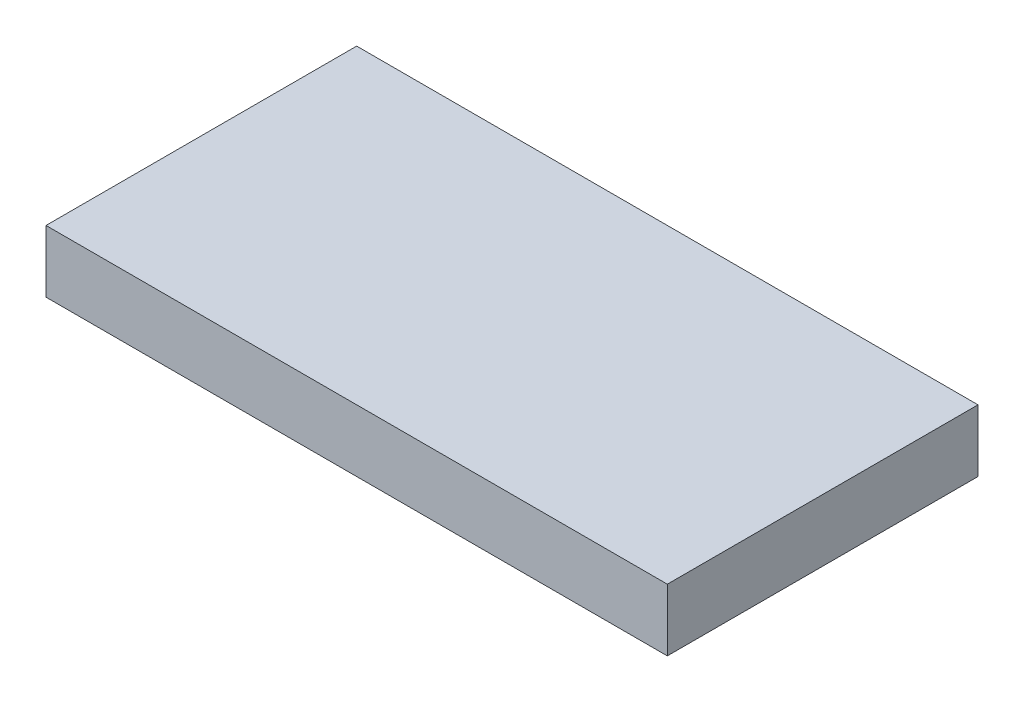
ISO-10303-21;
HEADER;
FILE_DESCRIPTION(('STEP AP214'),'2;1');
FILE_NAME('part.step','',(''),(''),'','','');
FILE_SCHEMA(('AUTOMOTIVE_DESIGN { 1 0 10303 214 1 1 1 1 }'));
ENDSEC;
DATA;
#1=APPLICATION_CONTEXT('core data for automotive mechanical design processes');
#2=APPLICATION_PROTOCOL_DEFINITION('international standard','automotive_design',2000,#1);
#3=PRODUCT_CONTEXT('',#1,'mechanical');
#4=PRODUCT('Part','Part','',(#3));
#5=PRODUCT_RELATED_PRODUCT_CATEGORY('part','',(#4));
#6=PRODUCT_DEFINITION_FORMATION('','',#4);
#7=PRODUCT_DEFINITION_CONTEXT('part definition',#1,'design');
#8=PRODUCT_DEFINITION('design','',#6,#7);
#9=PRODUCT_DEFINITION_SHAPE('','',#8);
#10=(LENGTH_UNIT() NAMED_UNIT(*) SI_UNIT(.MILLI.,.METRE.));
#11=(NAMED_UNIT(*) PLANE_ANGLE_UNIT() SI_UNIT($,.RADIAN.));
#12=(NAMED_UNIT(*) SI_UNIT($,.STERADIAN.) SOLID_ANGLE_UNIT());
#13=UNCERTAINTY_MEASURE_WITH_UNIT(LENGTH_MEASURE(1.E-05),#10,'distance_accuracy_value','');
#14=(GEOMETRIC_REPRESENTATION_CONTEXT(3) GLOBAL_UNCERTAINTY_ASSIGNED_CONTEXT((#13)) GLOBAL_UNIT_ASSIGNED_CONTEXT((#10,
#11,#12)) REPRESENTATION_CONTEXT('',''));
#15=CARTESIAN_POINT('',(0.,0.,0.));
#16=DIRECTION('',(0.,0.,1.));
#17=DIRECTION('',(1.,0.,0.));
#18=AXIS2_PLACEMENT_3D('',#15,#16,#17);
#19=CARTESIAN_POINT('',(127.,25.4,63.5));
#20=DIRECTION('',(-1.,0.,0.));
#21=DIRECTION('',(0.,0.,1.));
#22=AXIS2_PLACEMENT_3D('',#19,#20,#21);
#23=PLANE('',#22);
#24=DIRECTION('',(0.,0.,-1.));
#25=VECTOR('',#24,1.);
#26=CARTESIAN_POINT('',(127.,0.,63.5));
#27=LINE('',#26,#25);
#28=CARTESIAN_POINT('',(127.,0.,63.5));
#29=VERTEX_POINT('',#28);
#30=CARTESIAN_POINT('',(127.,0.,-63.5));
#31=VERTEX_POINT('',#30);
#32=EDGE_CURVE('E98',#29,#31,#27,.T.);
#33=ORIENTED_EDGE('',*,*,#32,.T.);
#34=DIRECTION('',(0.,-1.,0.));
#35=VECTOR('',#34,1.);
#36=CARTESIAN_POINT('',(127.,25.4,-63.5));
#37=LINE('',#36,#35);
#38=CARTESIAN_POINT('',(127.,25.4,-63.5));
#39=VERTEX_POINT('',#38);
#40=EDGE_CURVE('E11',#39,#31,#37,.T.);
#41=ORIENTED_EDGE('',*,*,#40,.F.);
#42=DIRECTION('',(0.,0.,-1.));
#43=VECTOR('',#42,1.);
#44=CARTESIAN_POINT('',(127.,25.4,63.5));
#45=LINE('',#44,#43);
#46=CARTESIAN_POINT('',(127.,25.4,63.5));
#47=VERTEX_POINT('',#46);
#48=EDGE_CURVE('E86',#47,#39,#45,.T.);
#49=ORIENTED_EDGE('',*,*,#48,.F.);
#50=DIRECTION('',(0.,-1.,0.));
#51=VECTOR('',#50,1.);
#52=CARTESIAN_POINT('',(127.,25.4,63.5));
#53=LINE('',#52,#51);
#54=EDGE_CURVE('E94',#47,#29,#53,.T.);
#55=ORIENTED_EDGE('',*,*,#54,.T.);
#56=EDGE_LOOP('',(#33,#41,#49,#55));
#57=FACE_BOUND('',#56,.T.);
#58=ADVANCED_FACE('F35',(#57),#23,.F.);
#59=CARTESIAN_POINT('',(-127.,25.4,-63.5));
#60=DIRECTION('',(0.,0.,1.));
#61=DIRECTION('',(1.,0.,0.));
#62=AXIS2_PLACEMENT_3D('',#59,#60,#61);
#63=PLANE('',#62);
#64=DIRECTION('',(-1.,0.,0.));
#65=VECTOR('',#64,1.);
#66=CARTESIAN_POINT('',(-127.,0.,-63.5));
#67=LINE('',#66,#65);
#68=CARTESIAN_POINT('',(-127.,0.,-63.5));
#69=VERTEX_POINT('',#68);
#70=EDGE_CURVE('E90',#31,#69,#67,.T.);
#71=ORIENTED_EDGE('',*,*,#70,.T.);
#72=DIRECTION('',(0.,-1.,0.));
#73=VECTOR('',#72,1.);
#74=CARTESIAN_POINT('',(-127.,25.4,-63.5));
#75=LINE('',#74,#73);
#76=CARTESIAN_POINT('',(-127.,25.4,-63.5));
#77=VERTEX_POINT('',#76);
#78=EDGE_CURVE('E43',#77,#69,#75,.T.);
#79=ORIENTED_EDGE('',*,*,#78,.F.);
#80=DIRECTION('',(-1.,0.,0.));
#81=VECTOR('',#80,1.);
#82=CARTESIAN_POINT('',(-127.,25.4,-63.5));
#83=LINE('',#82,#81);
#84=EDGE_CURVE('E81',#39,#77,#83,.T.);
#85=ORIENTED_EDGE('',*,*,#84,.F.);
#86=ORIENTED_EDGE('',*,*,#40,.T.);
#87=EDGE_LOOP('',(#71,#79,#85,#86));
#88=FACE_BOUND('',#87,.T.);
#89=ADVANCED_FACE('F89',(#88),#63,.F.);
#90=CARTESIAN_POINT('',(-127.,25.4,63.5));
#91=DIRECTION('',(1.,0.,0.));
#92=DIRECTION('',(0.,0.,-1.));
#93=AXIS2_PLACEMENT_3D('',#90,#91,#92);
#94=PLANE('',#93);
#95=DIRECTION('',(0.,0.,1.));
#96=VECTOR('',#95,1.);
#97=CARTESIAN_POINT('',(-127.,0.,63.5));
#98=LINE('',#97,#96);
#99=CARTESIAN_POINT('',(-127.,0.,63.5));
#100=VERTEX_POINT('',#99);
#101=EDGE_CURVE('E68',#69,#100,#98,.T.);
#102=ORIENTED_EDGE('',*,*,#101,.T.);
#103=DIRECTION('',(0.,-1.,0.));
#104=VECTOR('',#103,1.);
#105=CARTESIAN_POINT('',(-127.,25.4,63.5));
#106=LINE('',#105,#104);
#107=CARTESIAN_POINT('',(-127.,25.4,63.5));
#108=VERTEX_POINT('',#107);
#109=EDGE_CURVE('E91',#108,#100,#106,.T.);
#110=ORIENTED_EDGE('',*,*,#109,.F.);
#111=DIRECTION('',(0.,0.,1.));
#112=VECTOR('',#111,1.);
#113=CARTESIAN_POINT('',(-127.,25.4,63.5));
#114=LINE('',#113,#112);
#115=EDGE_CURVE('E84',#77,#108,#114,.T.);
#116=ORIENTED_EDGE('',*,*,#115,.F.);
#117=ORIENTED_EDGE('',*,*,#78,.T.);
#118=EDGE_LOOP('',(#102,#110,#116,#117));
#119=FACE_BOUND('',#118,.T.);
#120=ADVANCED_FACE('F92',(#119),#94,.F.);
#121=CARTESIAN_POINT('',(-127.,25.4,63.5));
#122=DIRECTION('',(0.,0.,-1.));
#123=DIRECTION('',(-1.,0.,0.));
#124=AXIS2_PLACEMENT_3D('',#121,#122,#123);
#125=PLANE('',#124);
#126=DIRECTION('',(1.,0.,0.));
#127=VECTOR('',#126,1.);
#128=CARTESIAN_POINT('',(-127.,0.,63.5));
#129=LINE('',#128,#127);
#130=EDGE_CURVE('E74',#100,#29,#129,.T.);
#131=ORIENTED_EDGE('',*,*,#130,.T.);
#132=ORIENTED_EDGE('',*,*,#54,.F.);
#133=DIRECTION('',(1.,0.,0.));
#134=VECTOR('',#133,1.);
#135=CARTESIAN_POINT('',(-127.,25.4,63.5));
#136=LINE('',#135,#134);
#137=EDGE_CURVE('E51',#108,#47,#136,.T.);
#138=ORIENTED_EDGE('',*,*,#137,.F.);
#139=ORIENTED_EDGE('',*,*,#109,.T.);
#140=EDGE_LOOP('',(#131,#132,#138,#139));
#141=FACE_BOUND('',#140,.T.);
#142=ADVANCED_FACE('F105',(#141),#125,.F.);
#143=CARTESIAN_POINT('',(0.,25.4,0.));
#144=DIRECTION('',(0.,-1.,0.));
#145=DIRECTION('',(0.,0.,-1.));
#146=AXIS2_PLACEMENT_3D('',#143,#144,#145);
#147=PLANE('',#146);
#148=ORIENTED_EDGE('',*,*,#48,.T.);
#149=ORIENTED_EDGE('',*,*,#84,.T.);
#150=ORIENTED_EDGE('',*,*,#115,.T.);
#151=ORIENTED_EDGE('',*,*,#137,.T.);
#152=EDGE_LOOP('',(#148,#149,#150,#151));
#153=FACE_BOUND('',#152,.T.);
#154=ADVANCED_FACE('F82',(#153),#147,.F.);
#155=CARTESIAN_POINT('',(0.,0.,0.));
#156=DIRECTION('',(0.,-1.,0.));
#157=DIRECTION('',(0.,0.,-1.));
#158=AXIS2_PLACEMENT_3D('',#155,#156,#157);
#159=PLANE('',#158);
#160=ORIENTED_EDGE('',*,*,#32,.F.);
#161=ORIENTED_EDGE('',*,*,#130,.F.);
#162=ORIENTED_EDGE('',*,*,#101,.F.);
#163=ORIENTED_EDGE('',*,*,#70,.F.);
#164=EDGE_LOOP('',(#160,#161,#162,#163));
#165=FACE_BOUND('',#164,.T.);
#166=ADVANCED_FACE('F108',(#165),#159,.T.);
#167=CLOSED_SHELL('',(#58,#89,#120,#142,#154,#166));
#168=MANIFOLD_SOLID_BREP('B2',#167);
#169=ADVANCED_BREP_SHAPE_REPRESENTATION('',(#18,#168),#14);
#170=SHAPE_DEFINITION_REPRESENTATION(#9,#169);
ENDSEC;
END-ISO-10303-21;
